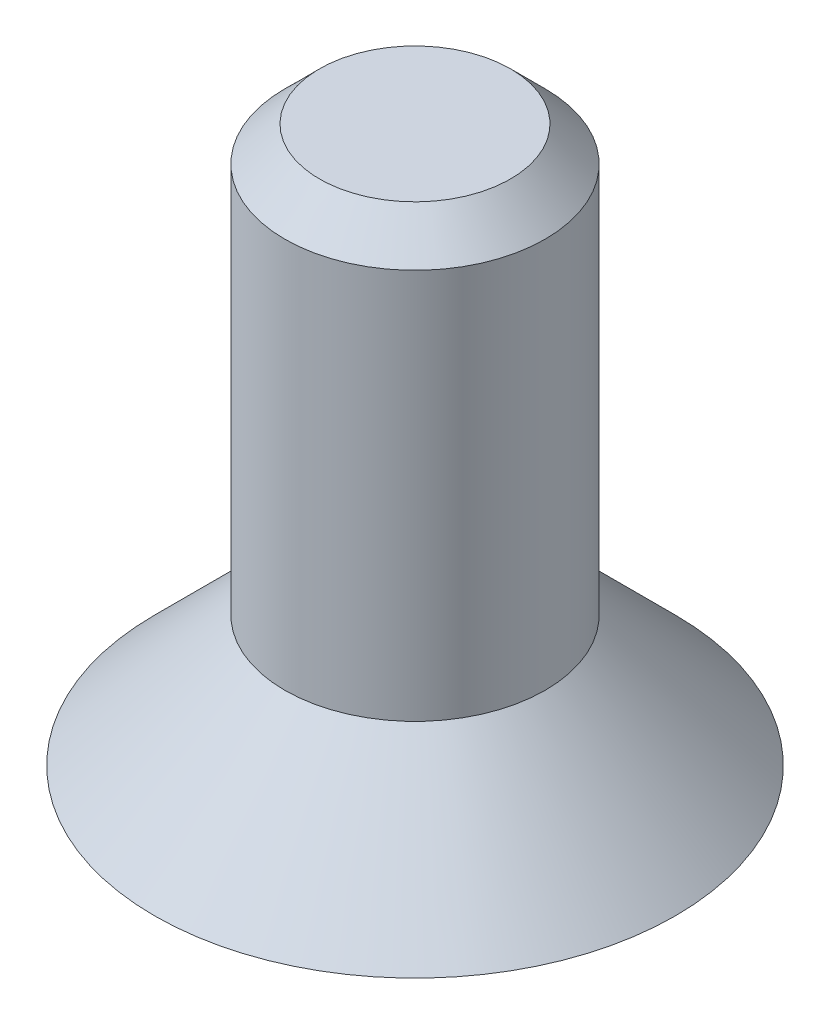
ISO-10303-21;
HEADER;
FILE_DESCRIPTION(('STEP AP214'),'2;1');
FILE_NAME('part.step','',(''),(''),'','','');
FILE_SCHEMA(('AUTOMOTIVE_DESIGN { 1 0 10303 214 1 1 1 1 }'));
ENDSEC;
DATA;
#1=APPLICATION_CONTEXT('core data for automotive mechanical design processes');
#2=APPLICATION_PROTOCOL_DEFINITION('international standard','automotive_design',2000,#1);
#3=PRODUCT_CONTEXT('',#1,'mechanical');
#4=PRODUCT('Part','Part','',(#3));
#5=PRODUCT_RELATED_PRODUCT_CATEGORY('part','',(#4));
#6=PRODUCT_DEFINITION_FORMATION('','',#4);
#7=PRODUCT_DEFINITION_CONTEXT('part definition',#1,'design');
#8=PRODUCT_DEFINITION('design','',#6,#7);
#9=PRODUCT_DEFINITION_SHAPE('','',#8);
#10=(LENGTH_UNIT() NAMED_UNIT(*) SI_UNIT(.MILLI.,.METRE.));
#11=(NAMED_UNIT(*) PLANE_ANGLE_UNIT() SI_UNIT($,.RADIAN.));
#12=(NAMED_UNIT(*) SI_UNIT($,.STERADIAN.) SOLID_ANGLE_UNIT());
#13=UNCERTAINTY_MEASURE_WITH_UNIT(LENGTH_MEASURE(1.E-05),#10,'distance_accuracy_value','');
#14=(GEOMETRIC_REPRESENTATION_CONTEXT(3) GLOBAL_UNCERTAINTY_ASSIGNED_CONTEXT((#13)) GLOBAL_UNIT_ASSIGNED_CONTEXT((#10,
#11,#12)) REPRESENTATION_CONTEXT('',''));
#15=CARTESIAN_POINT('',(0.,0.,0.));
#16=DIRECTION('',(0.,0.,1.));
#17=DIRECTION('',(1.,0.,0.));
#18=AXIS2_PLACEMENT_3D('',#15,#16,#17);
#19=CARTESIAN_POINT('',(0.,3.2,0.));
#20=DIRECTION('',(0.,-1.,0.));
#21=DIRECTION('',(0.,0.,-1.));
#22=AXIS2_PLACEMENT_3D('',#19,#20,#21);
#23=PLANE('',#22);
#24=CARTESIAN_POINT('',(0.,3.19999997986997,0.));
#25=DIRECTION('',(0.,-1.,0.));
#26=DIRECTION('',(0.,0.,-1.));
#27=AXIS2_PLACEMENT_3D('',#24,#25,#26);
#28=CIRCLE('',#27,0.549999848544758);
#29=CARTESIAN_POINT('',(0.,3.19999997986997,-0.549999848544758));
#30=VERTEX_POINT('',#29);
#31=EDGE_CURVE('E18',#30,#30,#28,.T.);
#32=ORIENTED_EDGE('',*,*,#31,.F.);
#33=EDGE_LOOP('',(#32));
#34=FACE_BOUND('',#33,.T.);
#35=ADVANCED_FACE('F15',(#34),#23,.F.);
#36=CARTESIAN_POINT('',(0.,2.99999979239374,0.));
#37=DIRECTION('',(0.,-1.,0.));
#38=DIRECTION('',(0.,0.,-1.));
#39=AXIS2_PLACEMENT_3D('',#36,#37,#38);
#40=CONICAL_SURFACE('',#39,0.749999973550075,0.785398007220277);
#41=CARTESIAN_POINT('',(0.,2.999999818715,0.));
#42=DIRECTION('',(0.,-1.,0.));
#43=DIRECTION('',(0.,0.,-1.));
#44=AXIS2_PLACEMENT_3D('',#41,#42,#43);
#45=CIRCLE('',#44,0.75);
#46=CARTESIAN_POINT('',(0.,2.999999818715,-0.75));
#47=VERTEX_POINT('',#46);
#48=EDGE_CURVE('E26',#47,#47,#45,.T.);
#49=ORIENTED_EDGE('',*,*,#48,.F.);
#50=EDGE_LOOP('',(#49));
#51=FACE_BOUND('',#50,.T.);
#52=ORIENTED_EDGE('',*,*,#31,.T.);
#53=EDGE_LOOP('',(#52));
#54=FACE_BOUND('',#53,.T.);
#55=ADVANCED_FACE('F35',(#51,#54),#40,.T.);
#56=CARTESIAN_POINT('',(0.,3.36,0.));
#57=DIRECTION('',(0.,-1.,0.));
#58=DIRECTION('',(0.,0.,-1.));
#59=AXIS2_PLACEMENT_3D('',#56,#57,#58);
#60=CYLINDRICAL_SURFACE('',#59,0.75);
#61=CARTESIAN_POINT('',(0.,0.749999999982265,0.));
#62=DIRECTION('',(0.,-1.,0.));
#63=DIRECTION('',(0.,0.,1.));
#64=AXIS2_PLACEMENT_3D('',#61,#62,#63);
#65=CIRCLE('',#64,0.750000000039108);
#66=CARTESIAN_POINT('',(0.,0.749999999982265,0.750000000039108));
#67=VERTEX_POINT('',#66);
#68=EDGE_CURVE('E22',#67,#67,#65,.T.);
#69=ORIENTED_EDGE('',*,*,#68,.F.);
#70=EDGE_LOOP('',(#69));
#71=FACE_BOUND('',#70,.T.);
#72=ORIENTED_EDGE('',*,*,#48,.T.);
#73=EDGE_LOOP('',(#72));
#74=FACE_BOUND('',#73,.T.);
#75=ADVANCED_FACE('F42',(#71,#74),#60,.T.);
#76=CARTESIAN_POINT('',(0.,5.6843418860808E-11,0.));
#77=DIRECTION('',(0.,-1.,0.));
#78=DIRECTION('',(0.,0.,-1.));
#79=AXIS2_PLACEMENT_3D('',#76,#77,#78);
#80=CONICAL_SURFACE('',#79,1.49999999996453,0.785398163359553);
#81=ORIENTED_EDGE('',*,*,#68,.T.);
#82=EDGE_LOOP('',(#81));
#83=FACE_BOUND('',#82,.T.);
#84=CARTESIAN_POINT('',(0.,0.,0.));
#85=DIRECTION('',(0.,-1.,0.));
#86=DIRECTION('',(0.,0.,-1.));
#87=AXIS2_PLACEMENT_3D('',#84,#85,#86);
#88=CIRCLE('',#87,1.50000000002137);
#89=CARTESIAN_POINT('',(0.,0.,-1.50000000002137));
#90=VERTEX_POINT('',#89);
#91=EDGE_CURVE('E10',#90,#90,#88,.T.);
#92=ORIENTED_EDGE('',*,*,#91,.F.);
#93=EDGE_LOOP('',(#92));
#94=FACE_BOUND('',#93,.T.);
#95=ADVANCED_FACE('F46',(#83,#94),#80,.T.);
#96=CARTESIAN_POINT('',(0.,0.,0.));
#97=DIRECTION('',(0.,-1.,0.));
#98=DIRECTION('',(0.,0.,-1.));
#99=AXIS2_PLACEMENT_3D('',#96,#97,#98);
#100=PLANE('',#99);
#101=ORIENTED_EDGE('',*,*,#91,.T.);
#102=EDGE_LOOP('',(#101));
#103=FACE_BOUND('',#102,.T.);
#104=ADVANCED_FACE('F44',(#103),#100,.T.);
#105=CLOSED_SHELL('',(#35,#55,#75,#95,#104));
#106=MANIFOLD_SOLID_BREP('B1',#105);
#107=ADVANCED_BREP_SHAPE_REPRESENTATION('',(#18,#106),#14);
#108=SHAPE_DEFINITION_REPRESENTATION(#9,#107);
ENDSEC;
END-ISO-10303-21;
